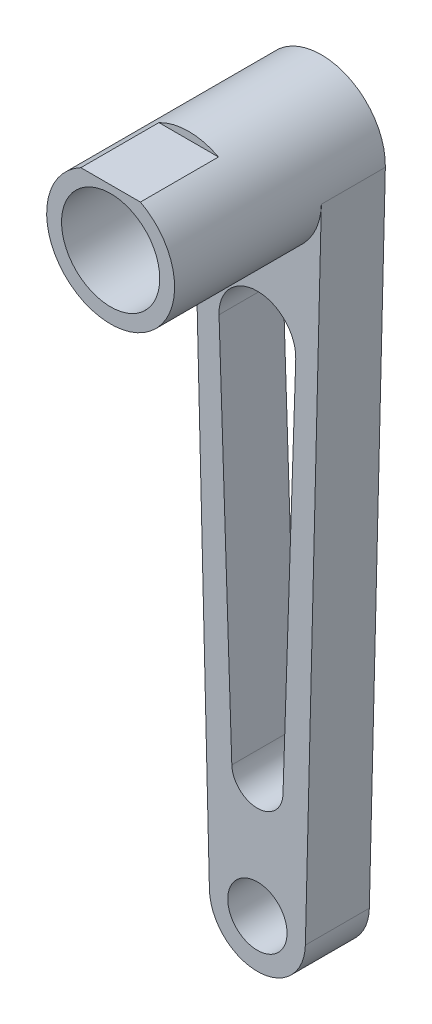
ISO-10303-21;
HEADER;
FILE_DESCRIPTION(('STEP AP214'),'2;1');
FILE_NAME('part.step','',(''),(''),'','','');
FILE_SCHEMA(('AUTOMOTIVE_DESIGN { 1 0 10303 214 1 1 1 1 }'));
ENDSEC;
DATA;
#1=APPLICATION_CONTEXT('core data for automotive mechanical design processes');
#2=APPLICATION_PROTOCOL_DEFINITION('international standard','automotive_design',2000,#1);
#3=PRODUCT_CONTEXT('',#1,'mechanical');
#4=PRODUCT('Part','Part','',(#3));
#5=PRODUCT_RELATED_PRODUCT_CATEGORY('part','',(#4));
#6=PRODUCT_DEFINITION_FORMATION('','',#4);
#7=PRODUCT_DEFINITION_CONTEXT('part definition',#1,'design');
#8=PRODUCT_DEFINITION('design','',#6,#7);
#9=PRODUCT_DEFINITION_SHAPE('','',#8);
#10=(LENGTH_UNIT() NAMED_UNIT(*) SI_UNIT(.MILLI.,.METRE.));
#11=(NAMED_UNIT(*) PLANE_ANGLE_UNIT() SI_UNIT($,.RADIAN.));
#12=(NAMED_UNIT(*) SI_UNIT($,.STERADIAN.) SOLID_ANGLE_UNIT());
#13=UNCERTAINTY_MEASURE_WITH_UNIT(LENGTH_MEASURE(1.E-05),#10,'distance_accuracy_value','');
#14=(GEOMETRIC_REPRESENTATION_CONTEXT(3) GLOBAL_UNCERTAINTY_ASSIGNED_CONTEXT((#13)) GLOBAL_UNIT_ASSIGNED_CONTEXT((#10,
#11,#12)) REPRESENTATION_CONTEXT('',''));
#15=CARTESIAN_POINT('',(0.,0.,0.));
#16=DIRECTION('',(0.,0.,1.));
#17=DIRECTION('',(1.,0.,0.));
#18=AXIS2_PLACEMENT_3D('',#15,#16,#17);
#19=CARTESIAN_POINT('',(0.,-83.,10.));
#20=DIRECTION('',(0.,0.,-1.));
#21=DIRECTION('',(-1.,0.,0.));
#22=AXIS2_PLACEMENT_3D('',#19,#20,#21);
#23=CYLINDRICAL_SURFACE('',#22,4.);
#24=CARTESIAN_POINT('',(0.,-83.,0.));
#25=DIRECTION('',(0.,0.,1.));
#26=DIRECTION('',(1.,0.,0.));
#27=AXIS2_PLACEMENT_3D('',#24,#25,#26);
#28=CIRCLE('',#27,4.);
#29=CARTESIAN_POINT('',(-3.99777716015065,-83.1333333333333,0.));
#30=VERTEX_POINT('',#29);
#31=CARTESIAN_POINT('',(3.99777716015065,-83.1333333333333,0.));
#32=VERTEX_POINT('',#31);
#33=EDGE_CURVE('E150',#30,#32,#28,.T.);
#34=ORIENTED_EDGE('',*,*,#33,.F.);
#35=DIRECTION('',(0.,0.,-1.));
#36=VECTOR('',#35,1.);
#37=CARTESIAN_POINT('',(-3.99777716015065,-83.1333333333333,10.));
#38=LINE('',#37,#36);
#39=CARTESIAN_POINT('',(-3.99777716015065,-83.1333333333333,10.));
#40=VERTEX_POINT('',#39);
#41=EDGE_CURVE('E124',#40,#30,#38,.T.);
#42=ORIENTED_EDGE('',*,*,#41,.F.);
#43=CARTESIAN_POINT('',(0.,-83.,10.));
#44=DIRECTION('',(0.,0.,1.));
#45=DIRECTION('',(1.,0.,0.));
#46=AXIS2_PLACEMENT_3D('',#43,#44,#45);
#47=CIRCLE('',#46,4.);
#48=CARTESIAN_POINT('',(3.99777716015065,-83.1333333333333,10.));
#49=VERTEX_POINT('',#48);
#50=EDGE_CURVE('E130',#40,#49,#47,.T.);
#51=ORIENTED_EDGE('',*,*,#50,.T.);
#52=DIRECTION('',(0.,0.,-1.));
#53=VECTOR('',#52,1.);
#54=CARTESIAN_POINT('',(3.99777716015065,-83.1333333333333,10.));
#55=LINE('',#54,#53);
#56=EDGE_CURVE('E93',#49,#32,#55,.T.);
#57=ORIENTED_EDGE('',*,*,#56,.T.);
#58=EDGE_LOOP('',(#34,#42,#51,#57));
#59=FACE_BOUND('',#58,.T.);
#60=ADVANCED_FACE('F38',(#59),#23,.F.);
#61=CARTESIAN_POINT('',(-6.76290636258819,-0.225555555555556,10.));
#62=DIRECTION('',(0.999444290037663,0.0333333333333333,0.));
#63=DIRECTION('',(-0.0333333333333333,0.999444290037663,0.));
#64=AXIS2_PLACEMENT_3D('',#61,#62,#63);
#65=PLANE('',#64);
#66=DIRECTION('',(0.0333333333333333,-0.999444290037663,0.));
#67=VECTOR('',#66,1.);
#68=CARTESIAN_POINT('',(-6.76290636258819,-0.225555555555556,0.));
#69=LINE('',#68,#67);
#70=CARTESIAN_POINT('',(-5.99666574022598,-23.2,0.));
#71=VERTEX_POINT('',#70);
#72=EDGE_CURVE('E119',#71,#30,#69,.T.);
#73=ORIENTED_EDGE('',*,*,#72,.F.);
#74=DIRECTION('',(0.,0.,-1.));
#75=VECTOR('',#74,1.);
#76=CARTESIAN_POINT('',(-5.99666574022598,-23.2,10.));
#77=LINE('',#76,#75);
#78=CARTESIAN_POINT('',(-5.99666574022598,-23.2,10.));
#79=VERTEX_POINT('',#78);
#80=EDGE_CURVE('E114',#79,#71,#77,.T.);
#81=ORIENTED_EDGE('',*,*,#80,.F.);
#82=DIRECTION('',(0.0333333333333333,-0.999444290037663,0.));
#83=VECTOR('',#82,1.);
#84=CARTESIAN_POINT('',(-6.76290636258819,-0.225555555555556,10.));
#85=LINE('',#84,#83);
#86=EDGE_CURVE('E117',#79,#40,#85,.T.);
#87=ORIENTED_EDGE('',*,*,#86,.T.);
#88=ORIENTED_EDGE('',*,*,#41,.T.);
#89=EDGE_LOOP('',(#73,#81,#87,#88));
#90=FACE_BOUND('',#89,.T.);
#91=ADVANCED_FACE('F116',(#90),#65,.T.);
#92=CARTESIAN_POINT('',(0.,-23.,10.));
#93=DIRECTION('',(0.,0.,-1.));
#94=DIRECTION('',(-1.,0.,0.));
#95=AXIS2_PLACEMENT_3D('',#92,#93,#94);
#96=CYLINDRICAL_SURFACE('',#95,6.);
#97=CARTESIAN_POINT('',(0.,-23.,0.));
#98=DIRECTION('',(0.,0.,1.));
#99=DIRECTION('',(1.,0.,0.));
#100=AXIS2_PLACEMENT_3D('',#97,#98,#99);
#101=CIRCLE('',#100,6.);
#102=CARTESIAN_POINT('',(5.99666574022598,-23.2,0.));
#103=VERTEX_POINT('',#102);
#104=EDGE_CURVE('E154',#103,#71,#101,.T.);
#105=ORIENTED_EDGE('',*,*,#104,.F.);
#106=DIRECTION('',(0.,0.,-1.));
#107=VECTOR('',#106,1.);
#108=CARTESIAN_POINT('',(5.99666574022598,-23.2,10.));
#109=LINE('',#108,#107);
#110=CARTESIAN_POINT('',(5.99666574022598,-23.2,10.));
#111=VERTEX_POINT('',#110);
#112=EDGE_CURVE('E125',#111,#103,#109,.T.);
#113=ORIENTED_EDGE('',*,*,#112,.F.);
#114=CARTESIAN_POINT('',(0.,-23.,10.));
#115=DIRECTION('',(0.,0.,1.));
#116=DIRECTION('',(1.,0.,0.));
#117=AXIS2_PLACEMENT_3D('',#114,#115,#116);
#118=CIRCLE('',#117,6.);
#119=EDGE_CURVE('E129',#111,#79,#118,.T.);
#120=ORIENTED_EDGE('',*,*,#119,.T.);
#121=ORIENTED_EDGE('',*,*,#80,.T.);
#122=EDGE_LOOP('',(#105,#113,#120,#121));
#123=FACE_BOUND('',#122,.T.);
#124=ADVANCED_FACE('F132',(#123),#96,.F.);
#125=CARTESIAN_POINT('',(-9.99697219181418,-0.246062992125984,10.));
#126=DIRECTION('',(0.999697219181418,0.0246062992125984,0.));
#127=DIRECTION('',(-0.0246062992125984,0.999697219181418,0.));
#128=AXIS2_PLACEMENT_3D('',#125,#126,#127);
#129=PLANE('',#128);
#130=DIRECTION('',(0.0246062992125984,-0.999697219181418,0.));
#131=VECTOR('',#130,1.);
#132=CARTESIAN_POINT('',(-9.99697219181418,-0.246062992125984,0.));
#133=LINE('',#132,#131);
#134=CARTESIAN_POINT('',(-9.99697219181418,-0.246062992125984,0.));
#135=VERTEX_POINT('',#134);
#136=CARTESIAN_POINT('',(-7.49772914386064,-101.784547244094,0.));
#137=VERTEX_POINT('',#136);
#138=EDGE_CURVE('E141',#135,#137,#133,.T.);
#139=ORIENTED_EDGE('',*,*,#138,.T.);
#140=DIRECTION('',(0.,0.,-1.));
#141=VECTOR('',#140,1.);
#142=CARTESIAN_POINT('',(-7.49772914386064,-101.784547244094,10.));
#143=LINE('',#142,#141);
#144=CARTESIAN_POINT('',(-7.49772914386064,-101.784547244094,10.));
#145=VERTEX_POINT('',#144);
#146=EDGE_CURVE('E163',#145,#137,#143,.T.);
#147=ORIENTED_EDGE('',*,*,#146,.F.);
#148=DIRECTION('',(0.0246062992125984,-0.999697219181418,0.));
#149=VECTOR('',#148,1.);
#150=CARTESIAN_POINT('',(-9.99697219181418,-0.246062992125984,10.));
#151=LINE('',#150,#149);
#152=CARTESIAN_POINT('',(-9.99697219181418,-0.246062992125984,10.));
#153=VERTEX_POINT('',#152);
#154=EDGE_CURVE('E161',#153,#145,#151,.T.);
#155=ORIENTED_EDGE('',*,*,#154,.F.);
#156=DIRECTION('',(0.,0.,-1.));
#157=VECTOR('',#156,1.);
#158=CARTESIAN_POINT('',(-9.99697219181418,-0.246062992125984,10.));
#159=LINE('',#158,#157);
#160=EDGE_CURVE('E140',#153,#135,#159,.T.);
#161=ORIENTED_EDGE('',*,*,#160,.T.);
#162=EDGE_LOOP('',(#139,#147,#155,#161));
#163=FACE_BOUND('',#162,.T.);
#164=ADVANCED_FACE('F40',(#163),#129,.F.);
#165=CARTESIAN_POINT('',(0.,-101.6,10.));
#166=DIRECTION('',(0.,0.,-1.));
#167=DIRECTION('',(-1.,0.,0.));
#168=AXIS2_PLACEMENT_3D('',#165,#166,#167);
#169=CYLINDRICAL_SURFACE('',#168,7.5);
#170=CARTESIAN_POINT('',(0.,-101.6,0.));
#171=DIRECTION('',(0.,0.,1.));
#172=DIRECTION('',(1.,0.,0.));
#173=AXIS2_PLACEMENT_3D('',#170,#171,#172);
#174=CIRCLE('',#173,7.5);
#175=CARTESIAN_POINT('',(7.49772914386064,-101.784547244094,0.));
#176=VERTEX_POINT('',#175);
#177=EDGE_CURVE('E144',#137,#176,#174,.T.);
#178=ORIENTED_EDGE('',*,*,#177,.T.);
#179=DIRECTION('',(0.,0.,-1.));
#180=VECTOR('',#179,1.);
#181=CARTESIAN_POINT('',(7.49772914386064,-101.784547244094,10.));
#182=LINE('',#181,#180);
#183=CARTESIAN_POINT('',(7.49772914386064,-101.784547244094,10.));
#184=VERTEX_POINT('',#183);
#185=EDGE_CURVE('E171',#184,#176,#182,.T.);
#186=ORIENTED_EDGE('',*,*,#185,.F.);
#187=CARTESIAN_POINT('',(0.,-101.6,10.));
#188=DIRECTION('',(0.,0.,1.));
#189=DIRECTION('',(1.,0.,0.));
#190=AXIS2_PLACEMENT_3D('',#187,#188,#189);
#191=CIRCLE('',#190,7.5);
#192=EDGE_CURVE('E102',#145,#184,#191,.T.);
#193=ORIENTED_EDGE('',*,*,#192,.F.);
#194=ORIENTED_EDGE('',*,*,#146,.T.);
#195=EDGE_LOOP('',(#178,#186,#193,#194));
#196=FACE_BOUND('',#195,.T.);
#197=ADVANCED_FACE('F229',(#196),#169,.T.);
#198=CARTESIAN_POINT('',(9.99697219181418,-0.246062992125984,10.));
#199=DIRECTION('',(-0.999697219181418,0.0246062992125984,0.));
#200=DIRECTION('',(-0.0246062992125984,-0.999697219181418,0.));
#201=AXIS2_PLACEMENT_3D('',#198,#199,#200);
#202=PLANE('',#201);
#203=DIRECTION('',(0.0246062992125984,0.999697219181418,0.));
#204=VECTOR('',#203,1.);
#205=CARTESIAN_POINT('',(9.99697219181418,-0.246062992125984,0.));
#206=LINE('',#205,#204);
#207=CARTESIAN_POINT('',(9.99697219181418,-0.246062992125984,0.));
#208=VERTEX_POINT('',#207);
#209=EDGE_CURVE('E147',#176,#208,#206,.T.);
#210=ORIENTED_EDGE('',*,*,#209,.T.);
#211=DIRECTION('',(0.,0.,-1.));
#212=VECTOR('',#211,1.);
#213=CARTESIAN_POINT('',(9.99697219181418,-0.246062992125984,10.));
#214=LINE('',#213,#212);
#215=CARTESIAN_POINT('',(9.99697219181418,-0.246062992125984,10.));
#216=VERTEX_POINT('',#215);
#217=EDGE_CURVE('E168',#216,#208,#214,.T.);
#218=ORIENTED_EDGE('',*,*,#217,.F.);
#219=DIRECTION('',(0.0246062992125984,0.999697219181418,0.));
#220=VECTOR('',#219,1.);
#221=CARTESIAN_POINT('',(9.99697219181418,-0.246062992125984,10.));
#222=LINE('',#221,#220);
#223=EDGE_CURVE('E208',#184,#216,#222,.T.);
#224=ORIENTED_EDGE('',*,*,#223,.F.);
#225=ORIENTED_EDGE('',*,*,#185,.T.);
#226=EDGE_LOOP('',(#210,#218,#224,#225));
#227=FACE_BOUND('',#226,.T.);
#228=ADVANCED_FACE('F221',(#227),#202,.F.);
#229=CARTESIAN_POINT('',(6.76290636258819,-0.225555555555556,10.));
#230=DIRECTION('',(0.999444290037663,-0.0333333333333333,0.));
#231=DIRECTION('',(0.0333333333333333,0.999444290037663,0.));
#232=AXIS2_PLACEMENT_3D('',#229,#230,#231);
#233=PLANE('',#232);
#234=DIRECTION('',(-0.0333333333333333,-0.999444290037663,0.));
#235=VECTOR('',#234,1.);
#236=CARTESIAN_POINT('',(6.76290636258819,-0.225555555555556,0.));
#237=LINE('',#236,#235);
#238=EDGE_CURVE('E156',#103,#32,#237,.T.);
#239=ORIENTED_EDGE('',*,*,#238,.T.);
#240=ORIENTED_EDGE('',*,*,#56,.F.);
#241=DIRECTION('',(-0.0333333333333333,-0.999444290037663,0.));
#242=VECTOR('',#241,1.);
#243=CARTESIAN_POINT('',(6.76290636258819,-0.225555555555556,10.));
#244=LINE('',#243,#242);
#245=EDGE_CURVE('E62',#111,#49,#244,.T.);
#246=ORIENTED_EDGE('',*,*,#245,.F.);
#247=ORIENTED_EDGE('',*,*,#112,.T.);
#248=EDGE_LOOP('',(#239,#240,#246,#247));
#249=FACE_BOUND('',#248,.T.);
#250=ADVANCED_FACE('F218',(#249),#233,.F.);
#251=CARTESIAN_POINT('',(0.,-101.6,10.));
#252=DIRECTION('',(0.,0.,-1.));
#253=DIRECTION('',(-1.,0.,0.));
#254=AXIS2_PLACEMENT_3D('',#251,#252,#253);
#255=CYLINDRICAL_SURFACE('',#254,4.635);
#256=CARTESIAN_POINT('',(0.,-101.6,10.));
#257=DIRECTION('',(0.,0.,1.));
#258=DIRECTION('',(1.,0.,0.));
#259=AXIS2_PLACEMENT_3D('',#256,#257,#258);
#260=CIRCLE('',#259,4.635);
#261=CARTESIAN_POINT('',(4.635,-101.6,10.));
#262=VERTEX_POINT('',#261);
#263=EDGE_CURVE('E134',#262,#262,#260,.T.);
#264=ORIENTED_EDGE('',*,*,#263,.T.);
#265=EDGE_LOOP('',(#264));
#266=FACE_BOUND('',#265,.T.);
#267=CARTESIAN_POINT('',(0.,-101.6,0.));
#268=DIRECTION('',(0.,0.,1.));
#269=DIRECTION('',(1.,0.,0.));
#270=AXIS2_PLACEMENT_3D('',#267,#268,#269);
#271=CIRCLE('',#270,4.635);
#272=CARTESIAN_POINT('',(4.635,-101.6,0.));
#273=VERTEX_POINT('',#272);
#274=EDGE_CURVE('E158',#273,#273,#271,.T.);
#275=ORIENTED_EDGE('',*,*,#274,.F.);
#276=EDGE_LOOP('',(#275));
#277=FACE_BOUND('',#276,.T.);
#278=ADVANCED_FACE('F220',(#266,#277),#255,.F.);
#279=CARTESIAN_POINT('',(0.,0.,10.));
#280=DIRECTION('',(0.,0.,1.));
#281=DIRECTION('',(1.,0.,0.));
#282=AXIS2_PLACEMENT_3D('',#279,#280,#281);
#283=PLANE('',#282);
#284=ORIENTED_EDGE('',*,*,#154,.T.);
#285=ORIENTED_EDGE('',*,*,#192,.T.);
#286=ORIENTED_EDGE('',*,*,#223,.T.);
#287=CARTESIAN_POINT('',(0.,0.,10.));
#288=DIRECTION('',(0.,0.,1.));
#289=DIRECTION('',(1.,0.,0.));
#290=AXIS2_PLACEMENT_3D('',#287,#288,#289);
#291=CIRCLE('',#290,10.);
#292=EDGE_CURVE('E211',#153,#216,#291,.T.);
#293=ORIENTED_EDGE('',*,*,#292,.F.);
#294=EDGE_LOOP('',(#284,#285,#286,#293));
#295=FACE_BOUND('',#294,.T.);
#296=ORIENTED_EDGE('',*,*,#50,.F.);
#297=ORIENTED_EDGE('',*,*,#86,.F.);
#298=ORIENTED_EDGE('',*,*,#119,.F.);
#299=ORIENTED_EDGE('',*,*,#245,.T.);
#300=EDGE_LOOP('',(#296,#297,#298,#299));
#301=FACE_BOUND('',#300,.T.);
#302=ORIENTED_EDGE('',*,*,#263,.F.);
#303=EDGE_LOOP('',(#302));
#304=FACE_BOUND('',#303,.T.);
#305=ADVANCED_FACE('F127',(#295,#301,#304),#283,.T.);
#306=CARTESIAN_POINT('',(0.,0.,0.));
#307=DIRECTION('',(0.,0.,1.));
#308=DIRECTION('',(1.,0.,0.));
#309=AXIS2_PLACEMENT_3D('',#306,#307,#308);
#310=PLANE('',#309);
#311=ORIENTED_EDGE('',*,*,#138,.F.);
#312=CARTESIAN_POINT('',(0.,0.,0.));
#313=DIRECTION('',(0.,0.,1.));
#314=DIRECTION('',(1.,0.,0.));
#315=AXIS2_PLACEMENT_3D('',#312,#313,#314);
#316=CIRCLE('',#315,10.);
#317=EDGE_CURVE('E197',#208,#135,#316,.T.);
#318=ORIENTED_EDGE('',*,*,#317,.F.);
#319=ORIENTED_EDGE('',*,*,#209,.F.);
#320=ORIENTED_EDGE('',*,*,#177,.F.);
#321=EDGE_LOOP('',(#311,#318,#319,#320));
#322=FACE_BOUND('',#321,.T.);
#323=ORIENTED_EDGE('',*,*,#33,.T.);
#324=ORIENTED_EDGE('',*,*,#238,.F.);
#325=ORIENTED_EDGE('',*,*,#104,.T.);
#326=ORIENTED_EDGE('',*,*,#72,.T.);
#327=EDGE_LOOP('',(#323,#324,#325,#326));
#328=FACE_BOUND('',#327,.T.);
#329=ORIENTED_EDGE('',*,*,#274,.T.);
#330=EDGE_LOOP('',(#329));
#331=FACE_BOUND('',#330,.T.);
#332=CARTESIAN_POINT('',(0.,0.,0.));
#333=DIRECTION('',(0.,0.,1.));
#334=DIRECTION('',(1.,0.,0.));
#335=AXIS2_PLACEMENT_3D('',#332,#333,#334);
#336=CIRCLE('',#335,7.675);
#337=CARTESIAN_POINT('',(7.675,0.,0.));
#338=VERTEX_POINT('',#337);
#339=EDGE_CURVE('E201',#338,#338,#336,.T.);
#340=ORIENTED_EDGE('',*,*,#339,.T.);
#341=EDGE_LOOP('',(#340));
#342=FACE_BOUND('',#341,.T.);
#343=ADVANCED_FACE('F215',(#322,#328,#331,#342),#310,.F.);
#344=CARTESIAN_POINT('',(0.,0.,32.94));
#345=DIRECTION('',(0.,0.,-1.));
#346=DIRECTION('',(-1.,0.,0.));
#347=AXIS2_PLACEMENT_3D('',#344,#345,#346);
#348=CYLINDRICAL_SURFACE('',#347,10.);
#349=CARTESIAN_POINT('',(0.,0.,32.94));
#350=DIRECTION('',(0.,0.,1.));
#351=DIRECTION('',(1.,0.,0.));
#352=AXIS2_PLACEMENT_3D('',#349,#350,#351);
#353=CIRCLE('',#352,10.);
#354=CARTESIAN_POINT('',(-4.65591022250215,8.85,32.94));
#355=VERTEX_POINT('',#354);
#356=CARTESIAN_POINT('',(4.65591022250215,8.85,32.94));
#357=VERTEX_POINT('',#356);
#358=EDGE_CURVE('E145',#355,#357,#353,.T.);
#359=ORIENTED_EDGE('',*,*,#358,.F.);
#360=DIRECTION('',(0.,0.,-1.));
#361=VECTOR('',#360,1.);
#362=CARTESIAN_POINT('',(-4.65591022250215,8.85,32.94));
#363=LINE('',#362,#361);
#364=CARTESIAN_POINT('',(-4.65591022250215,8.85,20.74));
#365=VERTEX_POINT('',#364);
#366=EDGE_CURVE('E53',#355,#365,#363,.T.);
#367=ORIENTED_EDGE('',*,*,#366,.T.);
#368=CARTESIAN_POINT('',(0.,0.,20.74));
#369=DIRECTION('',(0.,0.,1.));
#370=DIRECTION('',(1.,0.,0.));
#371=AXIS2_PLACEMENT_3D('',#368,#369,#370);
#372=CIRCLE('',#371,10.);
#373=CARTESIAN_POINT('',(4.65591022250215,8.85,20.74));
#374=VERTEX_POINT('',#373);
#375=EDGE_CURVE('E11',#374,#365,#372,.T.);
#376=ORIENTED_EDGE('',*,*,#375,.F.);
#377=DIRECTION('',(0.,0.,-1.));
#378=VECTOR('',#377,1.);
#379=CARTESIAN_POINT('',(4.65591022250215,8.85,32.94));
#380=LINE('',#379,#378);
#381=EDGE_CURVE('E179',#374,#357,#380,.F.);
#382=ORIENTED_EDGE('',*,*,#381,.T.);
#383=EDGE_LOOP('',(#359,#367,#376,#382));
#384=FACE_BOUND('',#383,.T.);
#385=ORIENTED_EDGE('',*,*,#317,.T.);
#386=ORIENTED_EDGE('',*,*,#160,.F.);
#387=ORIENTED_EDGE('',*,*,#292,.T.);
#388=ORIENTED_EDGE('',*,*,#217,.T.);
#389=EDGE_LOOP('',(#385,#386,#387,#388));
#390=FACE_BOUND('',#389,.T.);
#391=ADVANCED_FACE('F188',(#384,#390),#348,.T.);
#392=CARTESIAN_POINT('',(0.,0.,32.94));
#393=DIRECTION('',(0.,0.,-1.));
#394=DIRECTION('',(-1.,0.,0.));
#395=AXIS2_PLACEMENT_3D('',#392,#393,#394);
#396=CYLINDRICAL_SURFACE('',#395,7.675);
#397=CARTESIAN_POINT('',(0.,0.,32.94));
#398=DIRECTION('',(0.,0.,1.));
#399=DIRECTION('',(1.,0.,0.));
#400=AXIS2_PLACEMENT_3D('',#397,#398,#399);
#401=CIRCLE('',#400,7.675);
#402=CARTESIAN_POINT('',(7.675,0.,32.94));
#403=VERTEX_POINT('',#402);
#404=EDGE_CURVE('E194',#403,#403,#401,.T.);
#405=ORIENTED_EDGE('',*,*,#404,.T.);
#406=EDGE_LOOP('',(#405));
#407=FACE_BOUND('',#406,.T.);
#408=ORIENTED_EDGE('',*,*,#339,.F.);
#409=EDGE_LOOP('',(#408));
#410=FACE_BOUND('',#409,.T.);
#411=ADVANCED_FACE('F267',(#407,#410),#396,.F.);
#412=CARTESIAN_POINT('',(0.,0.,32.94));
#413=DIRECTION('',(0.,0.,1.));
#414=DIRECTION('',(1.,0.,0.));
#415=AXIS2_PLACEMENT_3D('',#412,#413,#414);
#416=PLANE('',#415);
#417=DIRECTION('',(1.,0.,0.));
#418=VECTOR('',#417,1.);
#419=CARTESIAN_POINT('',(0.,8.85,32.94));
#420=LINE('',#419,#418);
#421=EDGE_CURVE('E46',#355,#357,#420,.T.);
#422=ORIENTED_EDGE('',*,*,#421,.F.);
#423=ORIENTED_EDGE('',*,*,#358,.T.);
#424=EDGE_LOOP('',(#422,#423));
#425=FACE_BOUND('',#424,.T.);
#426=ORIENTED_EDGE('',*,*,#404,.F.);
#427=EDGE_LOOP('',(#426));
#428=FACE_BOUND('',#427,.T.);
#429=ADVANCED_FACE('F192',(#425,#428),#416,.T.);
#430=CARTESIAN_POINT('',(0.,0.,20.74));
#431=DIRECTION('',(0.,0.,1.));
#432=DIRECTION('',(1.,0.,0.));
#433=AXIS2_PLACEMENT_3D('',#430,#431,#432);
#434=PLANE('',#433);
#435=ORIENTED_EDGE('',*,*,#375,.T.);
#436=DIRECTION('',(1.,0.,0.));
#437=VECTOR('',#436,1.);
#438=CARTESIAN_POINT('',(-10.0333038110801,8.85,20.74));
#439=LINE('',#438,#437);
#440=EDGE_CURVE('E190',#365,#374,#439,.T.);
#441=ORIENTED_EDGE('',*,*,#440,.T.);
#442=EDGE_LOOP('',(#435,#441));
#443=FACE_BOUND('',#442,.T.);
#444=ADVANCED_FACE('F258',(#443),#434,.T.);
#445=CARTESIAN_POINT('',(-10.0333038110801,8.85,20.74));
#446=DIRECTION('',(0.,-1.,0.));
#447=DIRECTION('',(0.,0.,-1.));
#448=AXIS2_PLACEMENT_3D('',#445,#446,#447);
#449=PLANE('',#448);
#450=ORIENTED_EDGE('',*,*,#421,.T.);
#451=ORIENTED_EDGE('',*,*,#381,.F.);
#452=ORIENTED_EDGE('',*,*,#440,.F.);
#453=ORIENTED_EDGE('',*,*,#366,.F.);
#454=EDGE_LOOP('',(#450,#451,#452,#453));
#455=FACE_BOUND('',#454,.T.);
#456=ADVANCED_FACE('F177',(#455),#449,.F.);
#457=CLOSED_SHELL('',(#60,#91,#124,#164,#197,#228,#250,#278,#305,#343,#391,#411,#429,#444,#456));
#458=MANIFOLD_SOLID_BREP('B2',#457);
#459=ADVANCED_BREP_SHAPE_REPRESENTATION('',(#18,#458),#14);
#460=SHAPE_DEFINITION_REPRESENTATION(#9,#459);
ENDSEC;
END-ISO-10303-21;
